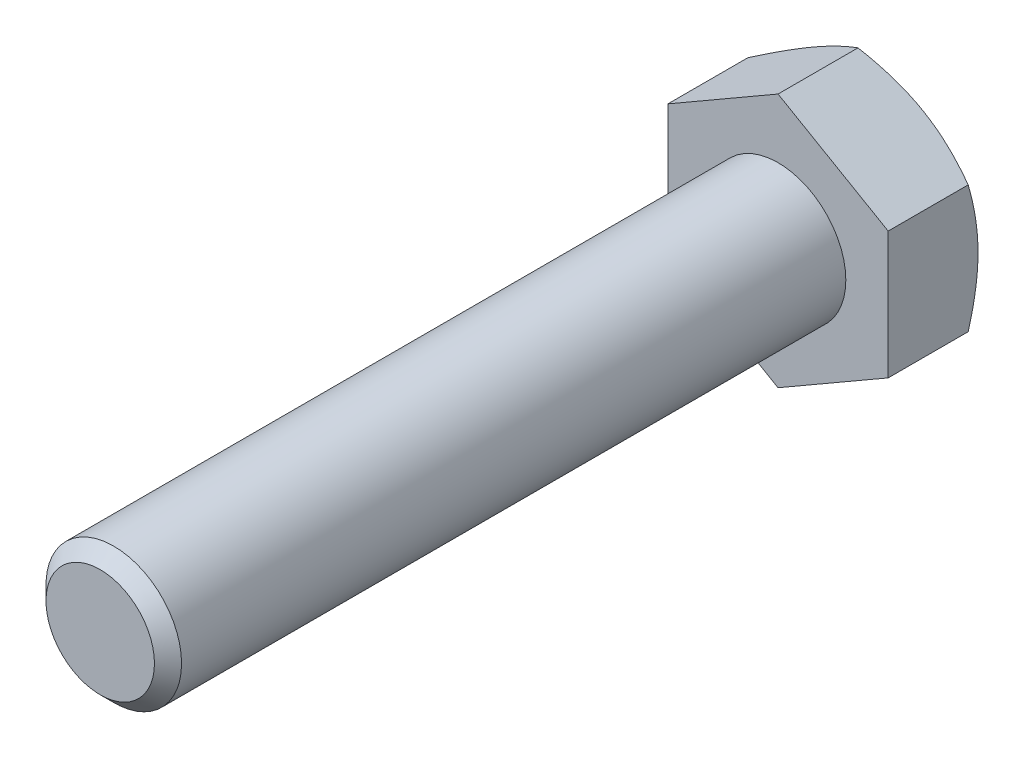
ISO-10303-21;
HEADER;
FILE_DESCRIPTION(('STEP AP214'),'2;1');
FILE_NAME('part.step','',(''),(''),'','','');
FILE_SCHEMA(('AUTOMOTIVE_DESIGN { 1 0 10303 214 1 1 1 1 }'));
ENDSEC;
DATA;
#1=APPLICATION_CONTEXT('core data for automotive mechanical design processes');
#2=APPLICATION_PROTOCOL_DEFINITION('international standard','automotive_design',2000,#1);
#3=PRODUCT_CONTEXT('',#1,'mechanical');
#4=PRODUCT('Part','Part','',(#3));
#5=PRODUCT_RELATED_PRODUCT_CATEGORY('part','',(#4));
#6=PRODUCT_DEFINITION_FORMATION('','',#4);
#7=PRODUCT_DEFINITION_CONTEXT('part definition',#1,'design');
#8=PRODUCT_DEFINITION('design','',#6,#7);
#9=PRODUCT_DEFINITION_SHAPE('','',#8);
#10=(LENGTH_UNIT() NAMED_UNIT(*) SI_UNIT(.MILLI.,.METRE.));
#11=(NAMED_UNIT(*) PLANE_ANGLE_UNIT() SI_UNIT($,.RADIAN.));
#12=(NAMED_UNIT(*) SI_UNIT($,.STERADIAN.) SOLID_ANGLE_UNIT());
#13=UNCERTAINTY_MEASURE_WITH_UNIT(LENGTH_MEASURE(1.E-05),#10,'distance_accuracy_value','');
#14=(GEOMETRIC_REPRESENTATION_CONTEXT(3) GLOBAL_UNCERTAINTY_ASSIGNED_CONTEXT((#13)) GLOBAL_UNIT_ASSIGNED_CONTEXT((#10,
#11,#12)) REPRESENTATION_CONTEXT('',''));
#15=CARTESIAN_POINT('',(0.,0.,0.));
#16=DIRECTION('',(0.,0.,1.));
#17=DIRECTION('',(1.,0.,0.));
#18=AXIS2_PLACEMENT_3D('',#15,#16,#17);
#19=CARTESIAN_POINT('',(0.,0.,40.));
#20=DIRECTION('',(0.,0.,1.));
#21=DIRECTION('',(1.,0.,0.));
#22=AXIS2_PLACEMENT_3D('',#19,#20,#21);
#23=PLANE('',#22);
#24=CARTESIAN_POINT('',(0.,0.,40.));
#25=DIRECTION('',(0.,0.,1.));
#26=DIRECTION('',(1.,0.,0.));
#27=AXIS2_PLACEMENT_3D('',#24,#25,#26);
#28=CIRCLE('',#27,3.2);
#29=CARTESIAN_POINT('',(3.2,0.,40.));
#30=VERTEX_POINT('',#29);
#31=EDGE_CURVE('E200',#30,#30,#28,.T.);
#32=ORIENTED_EDGE('',*,*,#31,.T.);
#33=EDGE_LOOP('',(#32));
#34=FACE_BOUND('',#33,.T.);
#35=ADVANCED_FACE('F26',(#34),#23,.T.);
#36=CARTESIAN_POINT('',(0.,0.,0.));
#37=DIRECTION('',(0.,0.,1.));
#38=DIRECTION('',(1.,0.,0.));
#39=AXIS2_PLACEMENT_3D('',#36,#37,#38);
#40=CYLINDRICAL_SURFACE('',#39,4.);
#41=CARTESIAN_POINT('',(0.,0.,39.2));
#42=DIRECTION('',(0.,0.,1.));
#43=DIRECTION('',(1.,0.,0.));
#44=AXIS2_PLACEMENT_3D('',#41,#42,#43);
#45=CIRCLE('',#44,4.);
#46=CARTESIAN_POINT('',(4.00000000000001,0.,39.2));
#47=VERTEX_POINT('',#46);
#48=EDGE_CURVE('E202',#47,#47,#45,.F.);
#49=ORIENTED_EDGE('',*,*,#48,.T.);
#50=EDGE_LOOP('',(#49));
#51=FACE_BOUND('',#50,.T.);
#52=CARTESIAN_POINT('',(0.,0.,0.));
#53=DIRECTION('',(0.,0.,1.));
#54=DIRECTION('',(1.,0.,0.));
#55=AXIS2_PLACEMENT_3D('',#52,#53,#54);
#56=CIRCLE('',#55,4.);
#57=CARTESIAN_POINT('',(4.,0.,0.));
#58=VERTEX_POINT('',#57);
#59=EDGE_CURVE('E203',#58,#58,#56,.F.);
#60=ORIENTED_EDGE('',*,*,#59,.F.);
#61=EDGE_LOOP('',(#60));
#62=FACE_BOUND('',#61,.T.);
#63=ADVANCED_FACE('F191',(#51,#62),#40,.T.);
#64=CARTESIAN_POINT('',(0.,0.,40.));
#65=DIRECTION('',(0.,0.,-1.));
#66=DIRECTION('',(-1.,0.,0.));
#67=AXIS2_PLACEMENT_3D('',#64,#65,#66);
#68=CONICAL_SURFACE('',#67,3.2,0.785398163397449);
#69=ORIENTED_EDGE('',*,*,#48,.F.);
#70=EDGE_LOOP('',(#69));
#71=FACE_BOUND('',#70,.T.);
#72=ORIENTED_EDGE('',*,*,#31,.F.);
#73=EDGE_LOOP('',(#72));
#74=FACE_BOUND('',#73,.T.);
#75=ADVANCED_FACE('F196',(#71,#74),#68,.T.);
#76=CARTESIAN_POINT('',(0.,7.50555349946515,-5.3));
#77=DIRECTION('',(0.499999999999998,0.86602540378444,0.));
#78=DIRECTION('',(-0.86602540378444,0.499999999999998,0.));
#79=AXIS2_PLACEMENT_3D('',#76,#77,#78);
#80=PLANE('',#79);
#81=CARTESIAN_POINT('',(-0.000200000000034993,7.50566896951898,-4.71937674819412));
#82=CARTESIAN_POINT('',(0.142677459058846,7.42317863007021,-4.7669955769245));
#83=CARTESIAN_POINT('',(0.286087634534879,7.34038072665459,-4.81245329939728));
#84=CARTESIAN_POINT('',(0.574072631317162,7.17411251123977,-4.89845131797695));
#85=CARTESIAN_POINT('',(0.718647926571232,7.09064192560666,-4.93898949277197));
#86=CARTESIAN_POINT('',(1.15468865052,6.8388936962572,-5.05242899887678));
#87=CARTESIAN_POINT('',(1.44787528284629,6.66962231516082,-5.11695219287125));
#88=CARTESIAN_POINT('',(1.88662374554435,6.41631077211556,-5.19261341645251));
#89=CARTESIAN_POINT('',(2.03087463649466,6.33302748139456,-5.21416714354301));
#90=CARTESIAN_POINT('',(2.32002821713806,6.16608458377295,-5.25030968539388));
#91=CARTESIAN_POINT('',(2.46493084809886,6.08242501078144,-5.26489911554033));
#92=CARTESIAN_POINT('',(2.7549877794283,5.91496056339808,-5.28674124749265));
#93=CARTESIAN_POINT('',(2.90014160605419,5.83115596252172,-5.29400227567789));
#94=CARTESIAN_POINT('',(3.19057533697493,5.66347396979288,-5.30103969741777));
#95=CARTESIAN_POINT('',(3.33585523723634,5.57959658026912,-5.3008163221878));
#96=CARTESIAN_POINT('',(3.73387594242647,5.34979921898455,-5.28991654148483));
#97=CARTESIAN_POINT('',(3.98648646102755,5.20395446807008,-5.27161818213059));
#98=CARTESIAN_POINT('',(4.49002967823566,4.91323365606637,-5.21359365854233));
#99=CARTESIAN_POINT('',(4.74096060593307,4.76835861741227,-5.17384766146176));
#100=CARTESIAN_POINT('',(5.24551722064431,4.47705272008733,-5.07449409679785));
#101=CARTESIAN_POINT('',(5.49907924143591,4.33065861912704,-5.01446557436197));
#102=CARTESIAN_POINT('',(6.00242193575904,4.04005357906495,-4.87822500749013));
#103=CARTESIAN_POINT('',(6.25220905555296,3.89583891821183,-4.8020449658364));
#104=CARTESIAN_POINT('',(6.5002,3.75266127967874,-4.71937674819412));
#105=B_SPLINE_CURVE_WITH_KNOTS('',3,(#81,#82,#83,#84,#85,#86,#87,#88,#89,#90,#91,#92,#93,#94,
#95,#96,#97,#98,#99,#100,#101,#102,#103,#104),.UNSPECIFIED.,.F.,.F.,(4,2,2,2,2,2,2,2,2,2,2,4),
(0.,0.51510505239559,1.03043143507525,2.06322554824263,2.56697389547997,3.07067772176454,
3.57380860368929,4.07692394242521,4.95279354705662,5.82947446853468,6.72559912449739,
7.61996451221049),.UNSPECIFIED.);
#106=CARTESIAN_POINT('',(0.,7.50555349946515,-4.71944341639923));
#107=VERTEX_POINT('',#106);
#108=CARTESIAN_POINT('',(3.24999999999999,5.62916512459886,-5.3));
#109=VERTEX_POINT('',#108);
#110=EDGE_CURVE('E236',#107,#109,#105,.T.);
#111=ORIENTED_EDGE('',*,*,#110,.F.);
#112=DIRECTION('',(0.,0.,1.));
#113=VECTOR('',#112,1.);
#114=CARTESIAN_POINT('',(0.,7.50555349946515,-5.3));
#115=LINE('',#114,#113);
#116=CARTESIAN_POINT('',(0.,7.50555349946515,0.));
#117=VERTEX_POINT('',#116);
#118=EDGE_CURVE('E210',#107,#117,#115,.T.);
#119=ORIENTED_EDGE('',*,*,#118,.T.);
#120=DIRECTION('',(-0.86602540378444,0.499999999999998,0.));
#121=VECTOR('',#120,1.);
#122=CARTESIAN_POINT('',(0.,7.50555349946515,0.));
#123=LINE('',#122,#121);
#124=CARTESIAN_POINT('',(6.5,3.75277674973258,0.));
#125=VERTEX_POINT('',#124);
#126=EDGE_CURVE('E234',#125,#117,#123,.T.);
#127=ORIENTED_EDGE('',*,*,#126,.F.);
#128=DIRECTION('',(0.,0.,1.));
#129=VECTOR('',#128,1.);
#130=CARTESIAN_POINT('',(6.5,3.75277674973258,-5.3));
#131=LINE('',#130,#129);
#132=CARTESIAN_POINT('',(6.5,3.75277674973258,-4.71944341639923));
#133=VERTEX_POINT('',#132);
#134=EDGE_CURVE('E207',#133,#125,#131,.T.);
#135=ORIENTED_EDGE('',*,*,#134,.F.);
#136=EDGE_CURVE('E166',#109,#133,#105,.T.);
#137=ORIENTED_EDGE('',*,*,#136,.F.);
#138=EDGE_LOOP('',(#111,#119,#127,#135,#137));
#139=FACE_BOUND('',#138,.T.);
#140=ADVANCED_FACE('F176',(#139),#80,.T.);
#141=CARTESIAN_POINT('',(6.5,-3.75277674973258,-5.3));
#142=DIRECTION('',(1.,0.,0.));
#143=DIRECTION('',(0.,0.,-1.));
#144=AXIS2_PLACEMENT_3D('',#141,#142,#143);
#145=PLANE('',#144);
#146=CARTESIAN_POINT('',(6.5,-10.2428264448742,-2.04883753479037));
#147=CARTESIAN_POINT('',(6.5,-9.95749123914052,-2.18789595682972));
#148=CARTESIAN_POINT('',(6.5,-9.67151814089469,-2.32566707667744));
#149=CARTESIAN_POINT('',(6.5,-9.09795746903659,-2.59791370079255));
#150=CARTESIAN_POINT('',(6.5,-8.81036966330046,-2.73238871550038));
#151=CARTESIAN_POINT('',(6.5,-8.23183597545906,-2.99796413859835));
#152=CARTESIAN_POINT('',(6.5,-7.94088042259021,-3.12904355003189));
#153=CARTESIAN_POINT('',(6.5,-7.35671087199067,-3.38604980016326));
#154=CARTESIAN_POINT('',(6.5,-7.06349697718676,-3.51197687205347));
#155=CARTESIAN_POINT('',(6.5,-6.46434920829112,-3.7614858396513));
#156=CARTESIAN_POINT('',(6.5,-6.15832132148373,-3.8848431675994));
#157=CARTESIAN_POINT('',(6.5,-5.54274557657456,-4.12260875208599));
#158=CARTESIAN_POINT('',(6.5,-5.23319733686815,-4.2370160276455));
#159=CARTESIAN_POINT('',(6.5,-4.61061796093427,-4.45399730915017));
#160=CARTESIAN_POINT('',(6.5,-4.29759477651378,-4.55659391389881));
#161=CARTESIAN_POINT('',(6.5,-3.66705774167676,-4.74676876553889));
#162=CARTESIAN_POINT('',(6.5,-3.34954528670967,-4.83435157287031));
#163=CARTESIAN_POINT('',(6.5,-2.71162315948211,-4.98994277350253));
#164=CARTESIAN_POINT('',(6.5,-2.3912406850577,-5.05806094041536));
#165=CARTESIAN_POINT('',(6.5,-1.74628166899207,-5.17096432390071));
#166=CARTESIAN_POINT('',(6.5,-1.4217055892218,-5.2157520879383));
#167=CARTESIAN_POINT('',(6.5,-0.935153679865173,-5.26247031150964));
#168=CARTESIAN_POINT('',(6.5,-0.774120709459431,-5.27461755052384));
#169=CARTESIAN_POINT('',(6.5,-0.451677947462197,-5.29209027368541));
#170=CARTESIAN_POINT('',(6.5,-0.290268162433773,-5.29741587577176));
#171=CARTESIAN_POINT('',(6.5,0.032631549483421,-5.30111032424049));
#172=CARTESIAN_POINT('',(6.5,0.194121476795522,-5.29947913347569));
#173=CARTESIAN_POINT('',(6.5,0.516885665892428,-5.28930353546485));
#174=CARTESIAN_POINT('',(6.5,0.678159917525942,-5.2807588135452));
#175=CARTESIAN_POINT('',(6.5,1.06087214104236,-5.2524625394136));
#176=CARTESIAN_POINT('',(6.5,1.28209274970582,-5.22970222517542));
#177=CARTESIAN_POINT('',(6.5,1.72298724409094,-5.17237790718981));
#178=CARTESIAN_POINT('',(6.5,1.94266093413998,-5.13781243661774));
#179=CARTESIAN_POINT('',(6.5,2.59905068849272,-5.01823337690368));
#180=CARTESIAN_POINT('',(6.5,3.03292018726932,-4.91735524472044));
#181=CARTESIAN_POINT('',(6.5,3.68203059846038,-4.74117763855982));
#182=CARTESIAN_POINT('',(6.5,3.90060192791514,-4.67743243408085));
#183=CARTESIAN_POINT('',(6.5,4.33562456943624,-4.54301317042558));
#184=CARTESIAN_POINT('',(6.5,4.55207586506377,-4.47233905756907));
#185=CARTESIAN_POINT('',(6.5,4.98292314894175,-4.3252213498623));
#186=CARTESIAN_POINT('',(6.5,5.19731969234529,-4.24877936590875));
#187=CARTESIAN_POINT('',(6.5,5.6243136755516,-4.09105605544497));
#188=CARTESIAN_POINT('',(6.5,5.8369111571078,-4.00977484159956));
#189=CARTESIAN_POINT('',(6.5,6.41107024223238,-3.78396124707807));
#190=CARTESIAN_POINT('',(6.5,6.77109993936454,-3.63553740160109));
#191=CARTESIAN_POINT('',(6.5,7.48742894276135,-3.32991367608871));
#192=CARTESIAN_POINT('',(6.5,7.8437278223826,-3.17271280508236));
#193=CARTESIAN_POINT('',(6.5,8.55345570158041,-2.85162072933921));
#194=CARTESIAN_POINT('',(6.5,8.90688352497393,-2.68772693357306));
#195=CARTESIAN_POINT('',(6.5,9.61131133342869,-2.35485675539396));
#196=CARTESIAN_POINT('',(6.5,9.96231141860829,-2.18588058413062));
#197=CARTESIAN_POINT('',(6.5,10.6629371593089,-1.84367823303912));
#198=CARTESIAN_POINT('',(6.5,11.0125596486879,-1.67044558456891));
#199=CARTESIAN_POINT('',(6.5,11.7102232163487,-1.32082260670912));
#200=CARTESIAN_POINT('',(6.5,12.058264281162,-1.14443225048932));
#201=CARTESIAN_POINT('',(6.5,12.7529700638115,-0.789156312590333));
#202=CARTESIAN_POINT('',(6.5,13.099635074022,-0.610271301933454));
#203=CARTESIAN_POINT('',(6.5,13.7918918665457,-0.250435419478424));
#204=CARTESIAN_POINT('',(6.5,14.1374836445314,-0.0694845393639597));
#205=CARTESIAN_POINT('',(6.5,15.099399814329,0.437179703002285));
#206=CARTESIAN_POINT('',(6.5,15.7147468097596,0.764748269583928));
#207=CARTESIAN_POINT('',(6.5,16.9433793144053,1.42381233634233));
#208=CARTESIAN_POINT('',(6.5,17.5566646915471,1.75530808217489));
#209=CARTESIAN_POINT('',(6.5,18.7795711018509,2.42008717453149));
#210=CARTESIAN_POINT('',(6.5,19.389197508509,2.75336064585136));
#211=CARTESIAN_POINT('',(6.5,20.6071616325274,3.42213981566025));
#212=CARTESIAN_POINT('',(6.5,21.2154994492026,3.75764533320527));
#213=CARTESIAN_POINT('',(6.5,21.8233856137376,4.09396124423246));
#214=B_SPLINE_CURVE_WITH_KNOTS('',3,(#146,#147,#148,#149,#150,#151,#152,#153,#154,#155,#156,
#157,#158,#159,#160,#161,#162,#163,#164,#165,#166,#167,#168,#169,#170,#171,#172,#173,#174,#175,
#176,#177,#178,#179,#180,#181,#182,#183,#184,#185,#186,#187,#188,#189,#190,#191,#192,#193,#194,
#195,#196,#197,#198,#199,#200,#201,#202,#203,#204,#205,#206,#207,#208,#209,#210,#211,#212,#213),
.UNSPECIFIED.,.F.,.F.,(4,2,2,2,2,2,2,2,2,2,2,2,2,2,2,2,2,2,2,2,2,2,2,2,2,2,2,2,2,2,2,2,2,4),(0.,
0.952261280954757,1.90466315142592,2.8619801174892,3.81925370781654,4.8090096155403,
5.798873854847,6.78681142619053,7.77444837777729,8.75640022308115,9.7382448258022,
10.2225937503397,10.7069343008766,11.1912774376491,11.6756426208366,12.3424346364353,
13.0093095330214,14.3437044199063,15.0266742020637,15.7096492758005,16.3924343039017,
17.0752034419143,18.2433007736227,19.4115302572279,20.580216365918,21.748853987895,
22.9193933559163,24.0899426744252,25.2602283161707,26.4305186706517,28.5218066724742,
30.6132261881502,32.6975528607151,34.7817125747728),.UNSPECIFIED.);
#215=CARTESIAN_POINT('',(6.5,0.,-5.3));
#216=VERTEX_POINT('',#215);
#217=EDGE_CURVE('E164',#133,#216,#214,.F.);
#218=ORIENTED_EDGE('',*,*,#217,.F.);
#219=ORIENTED_EDGE('',*,*,#134,.T.);
#220=DIRECTION('',(0.,1.,0.));
#221=VECTOR('',#220,1.);
#222=CARTESIAN_POINT('',(6.5,-3.75277674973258,0.));
#223=LINE('',#222,#221);
#224=CARTESIAN_POINT('',(6.5,-3.75277674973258,0.));
#225=VERTEX_POINT('',#224);
#226=EDGE_CURVE('E212',#225,#125,#223,.T.);
#227=ORIENTED_EDGE('',*,*,#226,.F.);
#228=DIRECTION('',(0.,0.,1.));
#229=VECTOR('',#228,1.);
#230=CARTESIAN_POINT('',(6.5,-3.75277674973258,-5.3));
#231=LINE('',#230,#229);
#232=CARTESIAN_POINT('',(6.5,-3.75277674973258,-4.71944341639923));
#233=VERTEX_POINT('',#232);
#234=EDGE_CURVE('E218',#233,#225,#231,.T.);
#235=ORIENTED_EDGE('',*,*,#234,.F.);
#236=EDGE_CURVE('E159',#216,#233,#214,.F.);
#237=ORIENTED_EDGE('',*,*,#236,.F.);
#238=EDGE_LOOP('',(#218,#219,#227,#235,#237));
#239=FACE_BOUND('',#238,.T.);
#240=ADVANCED_FACE('F172',(#239),#145,.T.);
#241=CARTESIAN_POINT('',(0.,-7.50555349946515,-5.3));
#242=DIRECTION('',(0.499999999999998,-0.86602540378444,0.));
#243=DIRECTION('',(0.86602540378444,0.499999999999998,0.));
#244=AXIS2_PLACEMENT_3D('',#241,#242,#243);
#245=PLANE('',#244);
#246=CARTESIAN_POINT('',(6.5002,-3.75266127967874,-4.71937674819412));
#247=CARTESIAN_POINT('',(6.35732254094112,-3.83515161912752,-4.76699557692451));
#248=CARTESIAN_POINT('',(6.21391236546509,-3.91794952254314,-4.81245329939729));
#249=CARTESIAN_POINT('',(5.9259273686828,-4.08421773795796,-4.89845131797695));
#250=CARTESIAN_POINT('',(5.78135207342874,-4.16768832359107,-4.93898949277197));
#251=CARTESIAN_POINT('',(5.34531134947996,-4.41943655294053,-5.05242899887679));
#252=CARTESIAN_POINT('',(5.05212471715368,-4.58870793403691,-5.11695219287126));
#253=CARTESIAN_POINT('',(4.61337625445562,-4.84201947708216,-5.19261341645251));
#254=CARTESIAN_POINT('',(4.4691253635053,-4.92530276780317,-5.21416714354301));
#255=CARTESIAN_POINT('',(4.1799717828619,-5.09224566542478,-5.25030968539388));
#256=CARTESIAN_POINT('',(4.0350691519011,-5.17590523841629,-5.26489911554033));
#257=CARTESIAN_POINT('',(3.74501222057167,-5.34336968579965,-5.28674124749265));
#258=CARTESIAN_POINT('',(3.59985839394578,-5.42717428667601,-5.29400227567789));
#259=CARTESIAN_POINT('',(3.30942466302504,-5.59485627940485,-5.30103969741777));
#260=CARTESIAN_POINT('',(3.16414476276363,-5.67873366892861,-5.3008163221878));
#261=CARTESIAN_POINT('',(2.76612405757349,-5.90853103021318,-5.28991654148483));
#262=CARTESIAN_POINT('',(2.51351353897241,-6.05437578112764,-5.27161818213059));
#263=CARTESIAN_POINT('',(2.0099703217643,-6.34509659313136,-5.21359365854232));
#264=CARTESIAN_POINT('',(1.7590393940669,-6.48997163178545,-5.17384766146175));
#265=CARTESIAN_POINT('',(1.25448277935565,-6.78127752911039,-5.07449409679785));
#266=CARTESIAN_POINT('',(1.00092075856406,-6.92767163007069,-5.01446557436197));
#267=CARTESIAN_POINT('',(0.497578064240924,-7.21827667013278,-4.87822500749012));
#268=CARTESIAN_POINT('',(0.247790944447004,-7.3624913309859,-4.8020449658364));
#269=CARTESIAN_POINT('',(-0.000200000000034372,-7.50566896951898,-4.71937674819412));
#270=B_SPLINE_CURVE_WITH_KNOTS('',3,(#246,#247,#248,#249,#250,#251,#252,#253,#254,#255,#256,
#257,#258,#259,#260,#261,#262,#263,#264,#265,#266,#267,#268,#269),.UNSPECIFIED.,.F.,.F.,(4,2,2,
2,2,2,2,2,2,2,2,4),(0.,0.515105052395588,1.03043143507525,2.06322554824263,2.56697389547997,
3.07067772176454,3.57380860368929,4.07692394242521,4.95279354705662,5.82947446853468,
6.72559912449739,7.61996451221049),.UNSPECIFIED.);
#271=CARTESIAN_POINT('',(3.24999999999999,-5.62916512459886,-5.3));
#272=VERTEX_POINT('',#271);
#273=EDGE_CURVE('E165',#233,#272,#270,.T.);
#274=ORIENTED_EDGE('',*,*,#273,.F.);
#275=ORIENTED_EDGE('',*,*,#234,.T.);
#276=DIRECTION('',(0.86602540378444,0.499999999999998,0.));
#277=VECTOR('',#276,1.);
#278=CARTESIAN_POINT('',(0.,-7.50555349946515,0.));
#279=LINE('',#278,#277);
#280=CARTESIAN_POINT('',(0.,-7.50555349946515,0.));
#281=VERTEX_POINT('',#280);
#282=EDGE_CURVE('E223',#281,#225,#279,.T.);
#283=ORIENTED_EDGE('',*,*,#282,.F.);
#284=DIRECTION('',(0.,0.,1.));
#285=VECTOR('',#284,1.);
#286=CARTESIAN_POINT('',(0.,-7.50555349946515,-5.3));
#287=LINE('',#286,#285);
#288=CARTESIAN_POINT('',(0.,-7.50555349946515,-4.71944341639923));
#289=VERTEX_POINT('',#288);
#290=EDGE_CURVE('E216',#289,#281,#287,.T.);
#291=ORIENTED_EDGE('',*,*,#290,.F.);
#292=EDGE_CURVE('E153',#272,#289,#270,.T.);
#293=ORIENTED_EDGE('',*,*,#292,.F.);
#294=EDGE_LOOP('',(#274,#275,#283,#291,#293));
#295=FACE_BOUND('',#294,.T.);
#296=ADVANCED_FACE('F175',(#295),#245,.T.);
#297=CARTESIAN_POINT('',(0.,-7.50555349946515,-5.3));
#298=DIRECTION('',(-0.500000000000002,-0.866025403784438,0.));
#299=DIRECTION('',(0.866025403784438,-0.500000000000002,0.));
#300=AXIS2_PLACEMENT_3D('',#297,#298,#299);
#301=PLANE('',#300);
#302=CARTESIAN_POINT('',(0.000199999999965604,-7.50566896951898,-4.71937674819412));
#303=CARTESIAN_POINT('',(-0.142677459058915,-7.42317863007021,-4.7669955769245));
#304=CARTESIAN_POINT('',(-0.286087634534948,-7.34038072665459,-4.81245329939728));
#305=CARTESIAN_POINT('',(-0.57407263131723,-7.17411251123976,-4.89845131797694));
#306=CARTESIAN_POINT('',(-0.718647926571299,-7.09064192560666,-4.93898949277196));
#307=CARTESIAN_POINT('',(-1.15468865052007,-6.83889369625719,-5.05242899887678));
#308=CARTESIAN_POINT('',(-1.44787528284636,-6.66962231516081,-5.11695219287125));
#309=CARTESIAN_POINT('',(-1.88662374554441,-6.41631077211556,-5.1926134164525));
#310=CARTESIAN_POINT('',(-2.03087463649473,-6.33302748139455,-5.214167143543));
#311=CARTESIAN_POINT('',(-2.32002821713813,-6.16608458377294,-5.25030968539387));
#312=CARTESIAN_POINT('',(-2.46493084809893,-6.08242501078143,-5.26489911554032));
#313=CARTESIAN_POINT('',(-2.75498777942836,-5.91496056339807,-5.28674124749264));
#314=CARTESIAN_POINT('',(-2.90014160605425,-5.8311559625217,-5.29400227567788));
#315=CARTESIAN_POINT('',(-3.19057533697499,-5.66347396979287,-5.30103969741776));
#316=CARTESIAN_POINT('',(-3.3358552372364,-5.5795965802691,-5.30081632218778));
#317=CARTESIAN_POINT('',(-3.73387594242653,-5.34979921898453,-5.28991654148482));
#318=CARTESIAN_POINT('',(-3.98648646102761,-5.20395446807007,-5.27161818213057));
#319=CARTESIAN_POINT('',(-4.49002967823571,-4.91323365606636,-5.21359365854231));
#320=CARTESIAN_POINT('',(-4.74096060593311,-4.76835861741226,-5.17384766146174));
#321=CARTESIAN_POINT('',(-5.24551722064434,-4.47705272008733,-5.07449409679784));
#322=CARTESIAN_POINT('',(-5.49907924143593,-4.33065861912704,-5.01446557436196));
#323=CARTESIAN_POINT('',(-6.00242193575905,-4.04005357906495,-4.87822500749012));
#324=CARTESIAN_POINT('',(-6.25220905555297,-3.89583891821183,-4.8020449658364));
#325=CARTESIAN_POINT('',(-6.5002,-3.75266127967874,-4.71937674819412));
#326=B_SPLINE_CURVE_WITH_KNOTS('',3,(#302,#303,#304,#305,#306,#307,#308,#309,#310,#311,#312,
#313,#314,#315,#316,#317,#318,#319,#320,#321,#322,#323,#324,#325),.UNSPECIFIED.,.F.,.F.,(4,2,2,
2,2,2,2,2,2,2,2,4),(0.,0.515105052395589,1.03043143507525,2.06322554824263,2.56697389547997,
3.07067772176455,3.57380860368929,4.07692394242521,4.9527935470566,5.82947446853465,
6.72559912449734,7.61996451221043),.UNSPECIFIED.);
#327=CARTESIAN_POINT('',(-3.25000000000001,-5.62916512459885,-5.3));
#328=VERTEX_POINT('',#327);
#329=EDGE_CURVE('E255',#289,#328,#326,.T.);
#330=ORIENTED_EDGE('',*,*,#329,.F.);
#331=ORIENTED_EDGE('',*,*,#290,.T.);
#332=DIRECTION('',(0.866025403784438,-0.500000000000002,0.));
#333=VECTOR('',#332,1.);
#334=CARTESIAN_POINT('',(0.,-7.50555349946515,0.));
#335=LINE('',#334,#333);
#336=CARTESIAN_POINT('',(-6.5,-3.75277674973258,0.));
#337=VERTEX_POINT('',#336);
#338=EDGE_CURVE('E226',#337,#281,#335,.T.);
#339=ORIENTED_EDGE('',*,*,#338,.F.);
#340=DIRECTION('',(0.,0.,1.));
#341=VECTOR('',#340,1.);
#342=CARTESIAN_POINT('',(-6.5,-3.75277674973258,-5.3));
#343=LINE('',#342,#341);
#344=CARTESIAN_POINT('',(-6.5,-3.75277674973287,-4.71944341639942));
#345=VERTEX_POINT('',#344);
#346=EDGE_CURVE('E214',#345,#337,#343,.T.);
#347=ORIENTED_EDGE('',*,*,#346,.F.);
#348=EDGE_CURVE('E102',#328,#345,#326,.T.);
#349=ORIENTED_EDGE('',*,*,#348,.F.);
#350=EDGE_LOOP('',(#330,#331,#339,#347,#349));
#351=FACE_BOUND('',#350,.T.);
#352=ADVANCED_FACE('F180',(#351),#301,.T.);
#353=CARTESIAN_POINT('',(-6.5,-3.75277674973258,-5.3));
#354=DIRECTION('',(-1.,0.,0.));
#355=DIRECTION('',(0.,0.,1.));
#356=AXIS2_PLACEMENT_3D('',#353,#354,#355);
#357=PLANE('',#356);
#358=CARTESIAN_POINT('',(-6.5,-10.2428264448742,-2.04883753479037));
#359=CARTESIAN_POINT('',(-6.5,-9.95749123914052,-2.18789595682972));
#360=CARTESIAN_POINT('',(-6.5,-9.67151814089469,-2.32566707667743));
#361=CARTESIAN_POINT('',(-6.5,-9.09795746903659,-2.59791370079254));
#362=CARTESIAN_POINT('',(-6.5,-8.81036966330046,-2.73238871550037));
#363=CARTESIAN_POINT('',(-6.5,-8.23183597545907,-2.99796413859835));
#364=CARTESIAN_POINT('',(-6.5,-7.94088042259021,-3.12904355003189));
#365=CARTESIAN_POINT('',(-6.5,-7.35671087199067,-3.38604980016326));
#366=CARTESIAN_POINT('',(-6.5,-7.06349697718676,-3.51197687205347));
#367=CARTESIAN_POINT('',(-6.5,-6.46434920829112,-3.7614858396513));
#368=CARTESIAN_POINT('',(-6.5,-6.15832132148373,-3.88484316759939));
#369=CARTESIAN_POINT('',(-6.5,-5.54274557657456,-4.12260875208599));
#370=CARTESIAN_POINT('',(-6.5,-5.23319733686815,-4.2370160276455));
#371=CARTESIAN_POINT('',(-6.5,-4.61061796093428,-4.45399730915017));
#372=CARTESIAN_POINT('',(-6.5,-4.29759477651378,-4.5565939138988));
#373=CARTESIAN_POINT('',(-6.5,-3.66705774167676,-4.74676876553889));
#374=CARTESIAN_POINT('',(-6.5,-3.34954528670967,-4.83435157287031));
#375=CARTESIAN_POINT('',(-6.5,-2.71162315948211,-4.98994277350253));
#376=CARTESIAN_POINT('',(-6.5,-2.3912406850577,-5.05806094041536));
#377=CARTESIAN_POINT('',(-6.5,-1.74628166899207,-5.17096432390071));
#378=CARTESIAN_POINT('',(-6.5,-1.4217055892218,-5.2157520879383));
#379=CARTESIAN_POINT('',(-6.5,-0.935153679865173,-5.26247031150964));
#380=CARTESIAN_POINT('',(-6.5,-0.774120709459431,-5.27461755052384));
#381=CARTESIAN_POINT('',(-6.5,-0.451677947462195,-5.29209027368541));
#382=CARTESIAN_POINT('',(-6.5,-0.290268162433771,-5.29741587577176));
#383=CARTESIAN_POINT('',(-6.5,0.0326315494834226,-5.30111032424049));
#384=CARTESIAN_POINT('',(-6.5,0.194121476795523,-5.29947913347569));
#385=CARTESIAN_POINT('',(-6.5,0.51688566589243,-5.28930353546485));
#386=CARTESIAN_POINT('',(-6.5,0.678159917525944,-5.2807588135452));
#387=CARTESIAN_POINT('',(-6.5,1.06087214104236,-5.2524625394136));
#388=CARTESIAN_POINT('',(-6.5,1.28209274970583,-5.22970222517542));
#389=CARTESIAN_POINT('',(-6.5,1.72298724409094,-5.17237790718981));
#390=CARTESIAN_POINT('',(-6.5,1.94266093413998,-5.13781243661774));
#391=CARTESIAN_POINT('',(-6.5,2.59905068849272,-5.01823337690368));
#392=CARTESIAN_POINT('',(-6.5,3.03292018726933,-4.91735524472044));
#393=CARTESIAN_POINT('',(-6.5,3.68203059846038,-4.74117763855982));
#394=CARTESIAN_POINT('',(-6.5,3.90060192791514,-4.67743243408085));
#395=CARTESIAN_POINT('',(-6.5,4.33562456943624,-4.54301317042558));
#396=CARTESIAN_POINT('',(-6.5,4.55207586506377,-4.47233905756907));
#397=CARTESIAN_POINT('',(-6.5,4.98292314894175,-4.3252213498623));
#398=CARTESIAN_POINT('',(-6.5,5.19731969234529,-4.24877936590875));
#399=CARTESIAN_POINT('',(-6.5,5.6243136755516,-4.09105605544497));
#400=CARTESIAN_POINT('',(-6.5,5.8369111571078,-4.00977484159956));
#401=CARTESIAN_POINT('',(-6.5,6.41107024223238,-3.78396124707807));
#402=CARTESIAN_POINT('',(-6.5,6.77109993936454,-3.63553740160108));
#403=CARTESIAN_POINT('',(-6.5,7.48742894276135,-3.32991367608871));
#404=CARTESIAN_POINT('',(-6.5,7.8437278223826,-3.17271280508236));
#405=CARTESIAN_POINT('',(-6.5,8.55345570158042,-2.85162072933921));
#406=CARTESIAN_POINT('',(-6.5,8.90688352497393,-2.68772693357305));
#407=CARTESIAN_POINT('',(-6.5,9.61131133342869,-2.35485675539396));
#408=CARTESIAN_POINT('',(-6.5,9.96231141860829,-2.18588058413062));
#409=CARTESIAN_POINT('',(-6.5,10.6629371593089,-1.84367823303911));
#410=CARTESIAN_POINT('',(-6.5,11.0125596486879,-1.67044558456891));
#411=CARTESIAN_POINT('',(-6.5,11.7102232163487,-1.32082260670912));
#412=CARTESIAN_POINT('',(-6.5,12.058264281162,-1.14443225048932));
#413=CARTESIAN_POINT('',(-6.5,12.7529700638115,-0.789156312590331));
#414=CARTESIAN_POINT('',(-6.5,13.099635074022,-0.610271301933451));
#415=CARTESIAN_POINT('',(-6.5,13.7918918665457,-0.250435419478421));
#416=CARTESIAN_POINT('',(-6.5,14.1374836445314,-0.0694845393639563));
#417=CARTESIAN_POINT('',(-6.5,15.099399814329,0.437179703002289));
#418=CARTESIAN_POINT('',(-6.5,15.7147468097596,0.764748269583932));
#419=CARTESIAN_POINT('',(-6.5,16.9433793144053,1.42381233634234));
#420=CARTESIAN_POINT('',(-6.5,17.5566646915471,1.7553080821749));
#421=CARTESIAN_POINT('',(-6.5,18.7795711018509,2.4200871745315));
#422=CARTESIAN_POINT('',(-6.5,19.389197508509,2.75336064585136));
#423=CARTESIAN_POINT('',(-6.5,20.6071616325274,3.42213981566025));
#424=CARTESIAN_POINT('',(-6.5,21.2154994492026,3.75764533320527));
#425=CARTESIAN_POINT('',(-6.5,21.8233856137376,4.09396124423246));
#426=B_SPLINE_CURVE_WITH_KNOTS('',3,(#358,#359,#360,#361,#362,#363,#364,#365,#366,#367,#368,
#369,#370,#371,#372,#373,#374,#375,#376,#377,#378,#379,#380,#381,#382,#383,#384,#385,#386,#387,
#388,#389,#390,#391,#392,#393,#394,#395,#396,#397,#398,#399,#400,#401,#402,#403,#404,#405,#406,
#407,#408,#409,#410,#411,#412,#413,#414,#415,#416,#417,#418,#419,#420,#421,#422,#423,#424,#425),
.UNSPECIFIED.,.F.,.F.,(4,2,2,2,2,2,2,2,2,2,2,2,2,2,2,2,2,2,2,2,2,2,2,2,2,2,2,2,2,2,2,2,2,4),(0.,
0.952261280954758,1.90466315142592,2.8619801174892,3.81925370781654,4.8090096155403,
5.798873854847,6.78681142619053,7.7744483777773,8.75640022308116,9.73824482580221,
10.2225937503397,10.7069343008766,11.1912774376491,11.6756426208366,12.3424346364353,
13.0093095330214,14.3437044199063,15.0266742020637,15.7096492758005,16.3924343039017,
17.0752034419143,18.2433007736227,19.4115302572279,20.580216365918,21.7488539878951,
22.9193933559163,24.0899426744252,25.2602283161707,26.4305186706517,28.5218066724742,
30.6132261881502,32.6975528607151,34.7817125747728),.UNSPECIFIED.);
#427=CARTESIAN_POINT('',(-6.5,0.,-5.3));
#428=VERTEX_POINT('',#427);
#429=EDGE_CURVE('E97',#345,#428,#426,.T.);
#430=ORIENTED_EDGE('',*,*,#429,.F.);
#431=ORIENTED_EDGE('',*,*,#346,.T.);
#432=DIRECTION('',(0.,-1.,0.));
#433=VECTOR('',#432,1.);
#434=CARTESIAN_POINT('',(-6.5,-3.75277674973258,0.));
#435=LINE('',#434,#433);
#436=CARTESIAN_POINT('',(-6.5,3.75277674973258,0.));
#437=VERTEX_POINT('',#436);
#438=EDGE_CURVE('E229',#437,#337,#435,.T.);
#439=ORIENTED_EDGE('',*,*,#438,.F.);
#440=DIRECTION('',(0.,0.,1.));
#441=VECTOR('',#440,1.);
#442=CARTESIAN_POINT('',(-6.5,3.75277674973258,-5.3));
#443=LINE('',#442,#441);
#444=CARTESIAN_POINT('',(-6.5,3.75277674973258,-4.71944341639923));
#445=VERTEX_POINT('',#444);
#446=EDGE_CURVE('E123',#445,#437,#443,.T.);
#447=ORIENTED_EDGE('',*,*,#446,.F.);
#448=EDGE_CURVE('E106',#428,#445,#426,.T.);
#449=ORIENTED_EDGE('',*,*,#448,.F.);
#450=EDGE_LOOP('',(#430,#431,#439,#447,#449));
#451=FACE_BOUND('',#450,.T.);
#452=ADVANCED_FACE('F121',(#451),#357,.T.);
#453=CARTESIAN_POINT('',(-6.5,3.75277674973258,-5.3));
#454=DIRECTION('',(-0.500000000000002,0.866025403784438,0.));
#455=DIRECTION('',(-0.866025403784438,-0.500000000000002,0.));
#456=AXIS2_PLACEMENT_3D('',#453,#454,#455);
#457=PLANE('',#456);
#458=CARTESIAN_POINT('',(-6.5002,3.75266127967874,-4.71937674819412));
#459=CARTESIAN_POINT('',(-6.35732254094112,3.83515161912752,-4.76699557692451));
#460=CARTESIAN_POINT('',(-6.21391236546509,3.91794952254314,-4.81245329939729));
#461=CARTESIAN_POINT('',(-5.92592736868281,4.08421773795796,-4.89845131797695));
#462=CARTESIAN_POINT('',(-5.78135207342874,4.16768832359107,-4.93898949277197));
#463=CARTESIAN_POINT('',(-5.34531134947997,4.41943655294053,-5.05242899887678));
#464=CARTESIAN_POINT('',(-5.05212471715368,4.58870793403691,-5.11695219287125));
#465=CARTESIAN_POINT('',(-4.61337625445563,4.84201947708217,-5.1926134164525));
#466=CARTESIAN_POINT('',(-4.46912536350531,4.92530276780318,-5.214167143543));
#467=CARTESIAN_POINT('',(-4.17997178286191,5.09224566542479,-5.25030968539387));
#468=CARTESIAN_POINT('',(-4.03506915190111,5.17590523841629,-5.26489911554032));
#469=CARTESIAN_POINT('',(-3.74501222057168,5.34336968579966,-5.28674124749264));
#470=CARTESIAN_POINT('',(-3.59985839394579,5.42717428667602,-5.29400227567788));
#471=CARTESIAN_POINT('',(-3.30942466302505,5.59485627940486,-5.30103969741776));
#472=CARTESIAN_POINT('',(-3.16414476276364,5.67873366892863,-5.30081632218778));
#473=CARTESIAN_POINT('',(-2.76612405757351,5.9085310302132,-5.28991654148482));
#474=CARTESIAN_POINT('',(-2.51351353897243,6.05437578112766,-5.27161818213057));
#475=CARTESIAN_POINT('',(-2.00997032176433,6.34509659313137,-5.21359365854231));
#476=CARTESIAN_POINT('',(-1.75903939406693,6.48997163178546,-5.17384766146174));
#477=CARTESIAN_POINT('',(-1.2544827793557,6.7812775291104,-5.07449409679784));
#478=CARTESIAN_POINT('',(-1.00092075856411,6.92767163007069,-5.01446557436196));
#479=CARTESIAN_POINT('',(-0.497578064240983,7.21827667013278,-4.87822500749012));
#480=CARTESIAN_POINT('',(-0.247790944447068,7.3624913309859,-4.8020449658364));
#481=CARTESIAN_POINT('',(0.000199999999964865,7.50566896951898,-4.71937674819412));
#482=B_SPLINE_CURVE_WITH_KNOTS('',3,(#458,#459,#460,#461,#462,#463,#464,#465,#466,#467,#468,
#469,#470,#471,#472,#473,#474,#475,#476,#477,#478,#479,#480,#481),.UNSPECIFIED.,.F.,.F.,(4,2,2,
2,2,2,2,2,2,2,2,4),(0.,0.515105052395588,1.03043143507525,2.06322554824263,2.56697389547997,
3.07067772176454,3.57380860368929,4.07692394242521,4.9527935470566,5.82947446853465,
6.72559912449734,7.61996451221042),.UNSPECIFIED.);
#483=CARTESIAN_POINT('',(-3.25000000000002,5.62916512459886,-5.3));
#484=VERTEX_POINT('',#483);
#485=EDGE_CURVE('E112',#445,#484,#482,.T.);
#486=ORIENTED_EDGE('',*,*,#485,.F.);
#487=ORIENTED_EDGE('',*,*,#446,.T.);
#488=DIRECTION('',(-0.866025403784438,-0.500000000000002,0.));
#489=VECTOR('',#488,1.);
#490=CARTESIAN_POINT('',(-6.5,3.75277674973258,0.));
#491=LINE('',#490,#489);
#492=EDGE_CURVE('E232',#117,#437,#491,.T.);
#493=ORIENTED_EDGE('',*,*,#492,.F.);
#494=ORIENTED_EDGE('',*,*,#118,.F.);
#495=EDGE_CURVE('E114',#484,#107,#482,.T.);
#496=ORIENTED_EDGE('',*,*,#495,.F.);
#497=EDGE_LOOP('',(#486,#487,#493,#494,#496));
#498=FACE_BOUND('',#497,.T.);
#499=ADVANCED_FACE('F188',(#498),#457,.T.);
#500=CARTESIAN_POINT('',(6.5,3.75277674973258,0.));
#501=DIRECTION('',(0.,0.,1.));
#502=DIRECTION('',(1.,0.,0.));
#503=AXIS2_PLACEMENT_3D('',#500,#501,#502);
#504=PLANE('',#503);
#505=ORIENTED_EDGE('',*,*,#59,.T.);
#506=EDGE_LOOP('',(#505));
#507=FACE_BOUND('',#506,.T.);
#508=ORIENTED_EDGE('',*,*,#126,.T.);
#509=ORIENTED_EDGE('',*,*,#492,.T.);
#510=ORIENTED_EDGE('',*,*,#438,.T.);
#511=ORIENTED_EDGE('',*,*,#338,.T.);
#512=ORIENTED_EDGE('',*,*,#282,.T.);
#513=ORIENTED_EDGE('',*,*,#226,.T.);
#514=EDGE_LOOP('',(#508,#509,#510,#511,#512,#513));
#515=FACE_BOUND('',#514,.T.);
#516=ADVANCED_FACE('F145',(#507,#515),#504,.T.);
#517=CARTESIAN_POINT('',(0.,0.,0.));
#518=DIRECTION('',(0.,0.,1.));
#519=DIRECTION('',(1.,0.,0.));
#520=AXIS2_PLACEMENT_3D('',#517,#518,#519);
#521=CONICAL_SURFACE('',#520,15.679869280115,1.0471975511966);
#522=ORIENTED_EDGE('',*,*,#136,.T.);
#523=ORIENTED_EDGE('',*,*,#217,.T.);
#524=CARTESIAN_POINT('',(0.,0.,-5.3));
#525=DIRECTION('',(0.,0.,1.));
#526=DIRECTION('',(1.,0.,0.));
#527=AXIS2_PLACEMENT_3D('',#524,#525,#526);
#528=CIRCLE('',#527,6.5);
#529=EDGE_CURVE('E29',#109,#216,#528,.F.);
#530=ORIENTED_EDGE('',*,*,#529,.F.);
#531=EDGE_LOOP('',(#522,#523,#530));
#532=FACE_BOUND('',#531,.T.);
#533=ADVANCED_FACE('F245',(#532),#521,.T.);
#534=ORIENTED_EDGE('',*,*,#110,.T.);
#535=EDGE_CURVE('E119',#484,#109,#528,.F.);
#536=ORIENTED_EDGE('',*,*,#535,.F.);
#537=ORIENTED_EDGE('',*,*,#495,.T.);
#538=EDGE_LOOP('',(#534,#536,#537));
#539=FACE_BOUND('',#538,.T.);
#540=ADVANCED_FACE('F144',(#539),#521,.T.);
#541=ORIENTED_EDGE('',*,*,#448,.T.);
#542=ORIENTED_EDGE('',*,*,#485,.T.);
#543=CARTESIAN_POINT('',(0.,0.,-5.3));
#544=DIRECTION('',(0.,0.,-1.));
#545=DIRECTION('',(-1.,0.,0.));
#546=AXIS2_PLACEMENT_3D('',#543,#544,#545);
#547=CIRCLE('',#546,6.5);
#548=EDGE_CURVE('E47',#428,#484,#547,.T.);
#549=ORIENTED_EDGE('',*,*,#548,.F.);
#550=EDGE_LOOP('',(#541,#542,#549));
#551=FACE_BOUND('',#550,.T.);
#552=ADVANCED_FACE('F110',(#551),#521,.T.);
#553=ORIENTED_EDGE('',*,*,#348,.T.);
#554=ORIENTED_EDGE('',*,*,#429,.T.);
#555=EDGE_CURVE('E99',#328,#428,#528,.F.);
#556=ORIENTED_EDGE('',*,*,#555,.F.);
#557=EDGE_LOOP('',(#553,#554,#556));
#558=FACE_BOUND('',#557,.T.);
#559=ADVANCED_FACE('F98',(#558),#521,.T.);
#560=ORIENTED_EDGE('',*,*,#292,.T.);
#561=ORIENTED_EDGE('',*,*,#329,.T.);
#562=EDGE_CURVE('E34',#272,#328,#528,.F.);
#563=ORIENTED_EDGE('',*,*,#562,.F.);
#564=EDGE_LOOP('',(#560,#561,#563));
#565=FACE_BOUND('',#564,.T.);
#566=ADVANCED_FACE('F257',(#565),#521,.T.);
#567=ORIENTED_EDGE('',*,*,#236,.T.);
#568=ORIENTED_EDGE('',*,*,#273,.T.);
#569=EDGE_CURVE('E11',#216,#272,#528,.F.);
#570=ORIENTED_EDGE('',*,*,#569,.F.);
#571=EDGE_LOOP('',(#567,#568,#570));
#572=FACE_BOUND('',#571,.T.);
#573=ADVANCED_FACE('F252',(#572),#521,.T.);
#574=CARTESIAN_POINT('',(6.5,3.75277674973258,-5.3));
#575=DIRECTION('',(0.,0.,1.));
#576=DIRECTION('',(1.,0.,0.));
#577=AXIS2_PLACEMENT_3D('',#574,#575,#576);
#578=PLANE('',#577);
#579=ORIENTED_EDGE('',*,*,#529,.T.);
#580=ORIENTED_EDGE('',*,*,#569,.T.);
#581=ORIENTED_EDGE('',*,*,#562,.T.);
#582=ORIENTED_EDGE('',*,*,#555,.T.);
#583=ORIENTED_EDGE('',*,*,#548,.T.);
#584=ORIENTED_EDGE('',*,*,#535,.T.);
#585=EDGE_LOOP('',(#579,#580,#581,#582,#583,#584));
#586=FACE_BOUND('',#585,.T.);
#587=ADVANCED_FACE('F117',(#586),#578,.F.);
#588=CLOSED_SHELL('',(#35,#63,#75,#140,#240,#296,#352,#452,#499,#516,#533,#540,#552,#559,#566,
#573,#587));
#589=MANIFOLD_SOLID_BREP('B2',#588);
#590=ADVANCED_BREP_SHAPE_REPRESENTATION('',(#18,#589),#14);
#591=SHAPE_DEFINITION_REPRESENTATION(#9,#590);
ENDSEC;
END-ISO-10303-21;
